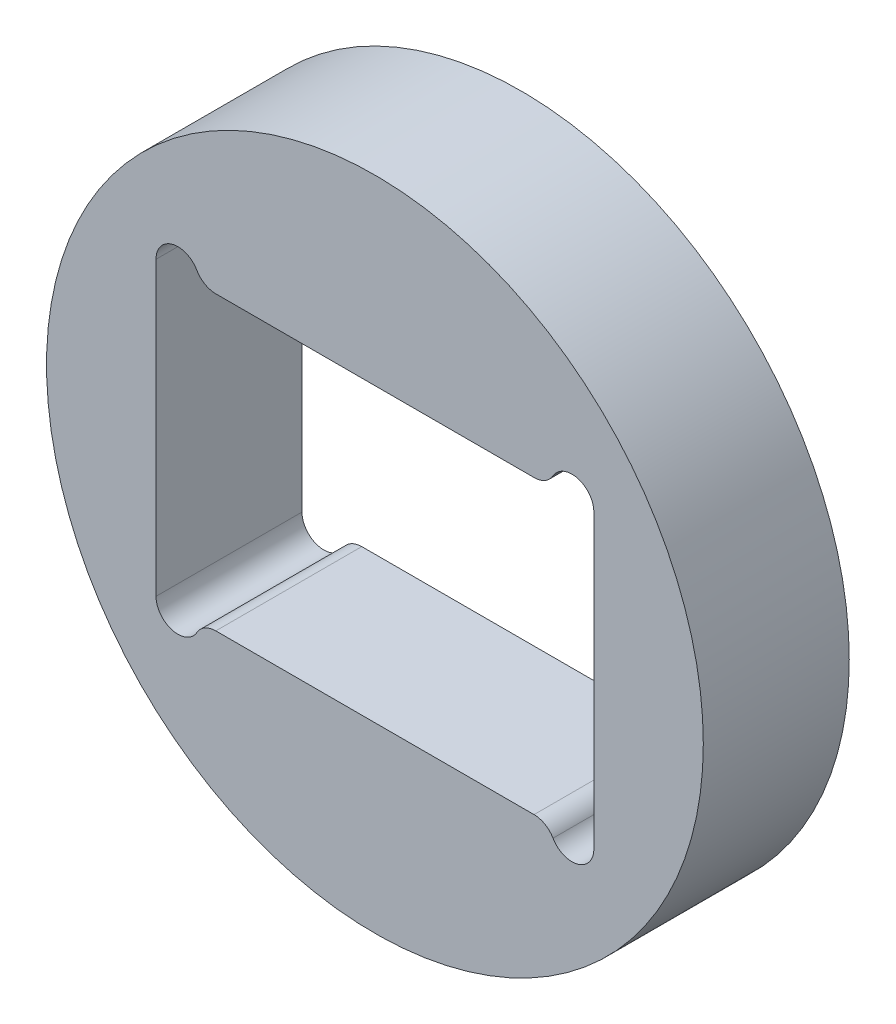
from build123d import *

# Parameters (mm, degrees)
ESQUISSE1_R        = 22.5
BOSS_EXTRU_1_DEPTH = 10


with BuildPart() as part:
    # Esquisse1 → Boss.-Extru.1 (new body)
    with BuildSketch(Plane.XY):
        with Locations((-62.046476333, 20.020145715)):
            Circle(ESQUISSE1_R)
        with BuildLine():
            Line((-47.046476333, 30.020145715), (-47.046476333, 10.020145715))
            ThreePointArc((-47.046476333, 10.020145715), (-48.158247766, 8.571256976), (-49.845514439, 9.270145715))
            ThreePointArc((-49.845514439, 9.270145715), (-50.394552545, 9.819183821), (-51.144552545, 10.020145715))
            Line((-51.144552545, 10.020145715), (-72.948400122, 10.020145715))
            ThreePointArc((-72.948400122, 10.020145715), (-73.698400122, 9.819183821), (-74.247438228, 9.270145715))
            ThreePointArc((-74.247438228, 9.270145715), (-75.934704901, 8.571256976), (-77.046476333, 10.020145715))
            Line((-77.046476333, 10.020145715), (-77.046476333, 30.020145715))
            ThreePointArc((-77.046476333, 30.020145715), (-75.934704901, 31.469034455), (-74.247438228, 30.770145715))
            ThreePointArc((-74.247438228, 30.770145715), (-73.698400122, 30.22110761), (-72.948400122, 30.020145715))
            Line((-72.948400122, 30.020145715), (-51.144552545, 30.020145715))
            ThreePointArc((-51.144552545, 30.020145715), (-50.394552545, 30.22110761), (-49.845514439, 30.770145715))
            ThreePointArc((-49.845514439, 30.770145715), (-48.158247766, 31.469034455), (-47.046476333, 30.020145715))
        make_face(mode=Mode.SUBTRACT)
    extrude(amount=BOSS_EXTRU_1_DEPTH)


solid = part.part
